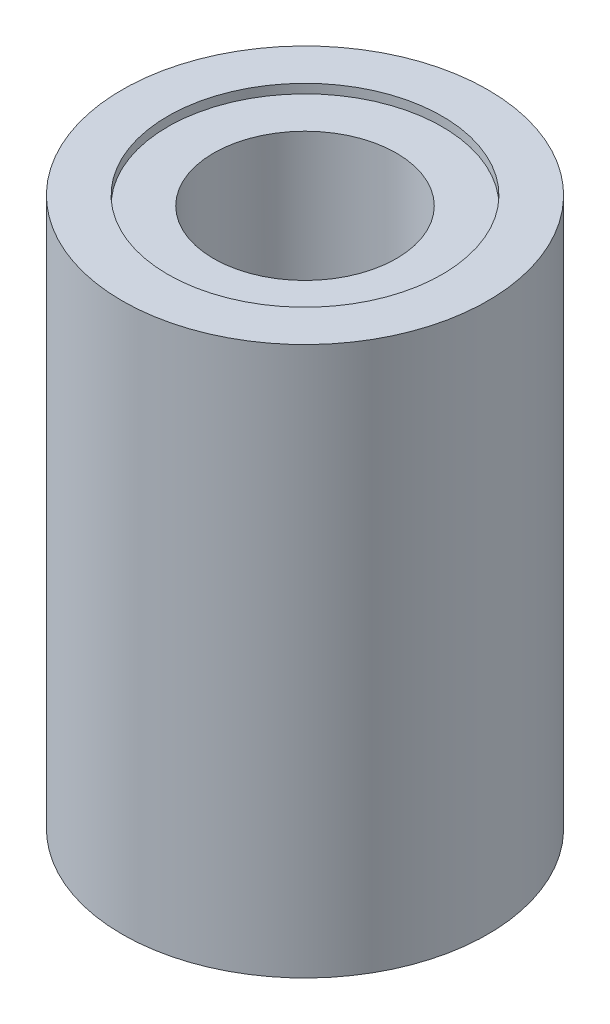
from build123d import *

# Parameters (mm, degrees)
SCHIZZO1_R                   = 4
SCHIZZO1_R_2                 = 2
ESTRUSIONE_ESTRUSIONE1_DEPTH = 12
TAGLIO_ESTRUSIONE1_START     = -0.2
SCHIZZO2_R                   = 3
SCHIZZO2_R_2                 = 2
TAGLIO_ESTRUSIONE1_DEPTH     = 0.2
SCHIZZO3_R                   = 3
SCHIZZO3_R_2                 = 2
TAGLIO_ESTRUSIONE2_DEPTH     = 0.2


with BuildPart() as part:
    # Schizzo1 → Estrusione-Estrusione1 (new body)
    with BuildSketch(Plane(origin=(0, 0, 0), x_dir=(1, 0, 0), z_dir=(0, 1, 0))):
        with Locations(Location((0, 0, 0), (0, 0, 270))):
            Circle(SCHIZZO1_R)
        with Locations(Location((0, 0, 0), (0, 0, 270))):
            Circle(SCHIZZO1_R_2, mode=Mode.SUBTRACT)
    extrude(amount=ESTRUSIONE_ESTRUSIONE1_DEPTH)

    # Schizzo2 → Taglio-Estrusione1 (cut)
    with BuildSketch(Plane(origin=(0, 12, 0), x_dir=(1, 0, 0), z_dir=(0, 1, 0)).offset(TAGLIO_ESTRUSIONE1_START)):
        with Locations(Location((0, 0, 0), (0, 0, 270))):
            Circle(SCHIZZO2_R)
        with Locations(Location((0, 0, 0), (0, 0, 270))):
            Circle(SCHIZZO2_R_2, mode=Mode.SUBTRACT)
    extrude(amount=TAGLIO_ESTRUSIONE1_DEPTH, mode=Mode.SUBTRACT)

    # Schizzo3 → Taglio-Estrusione2 (cut)
    with BuildSketch(Plane.XZ):
        with Locations(Location((0, 0, 0), (0, 0, 90))):
            Circle(SCHIZZO3_R)
        with Locations(Location((0, 0, 0), (0, 0, 270))):
            Circle(SCHIZZO3_R_2, mode=Mode.SUBTRACT)
    extrude(amount=-TAGLIO_ESTRUSIONE2_DEPTH, mode=Mode.SUBTRACT)


solid = part.part
